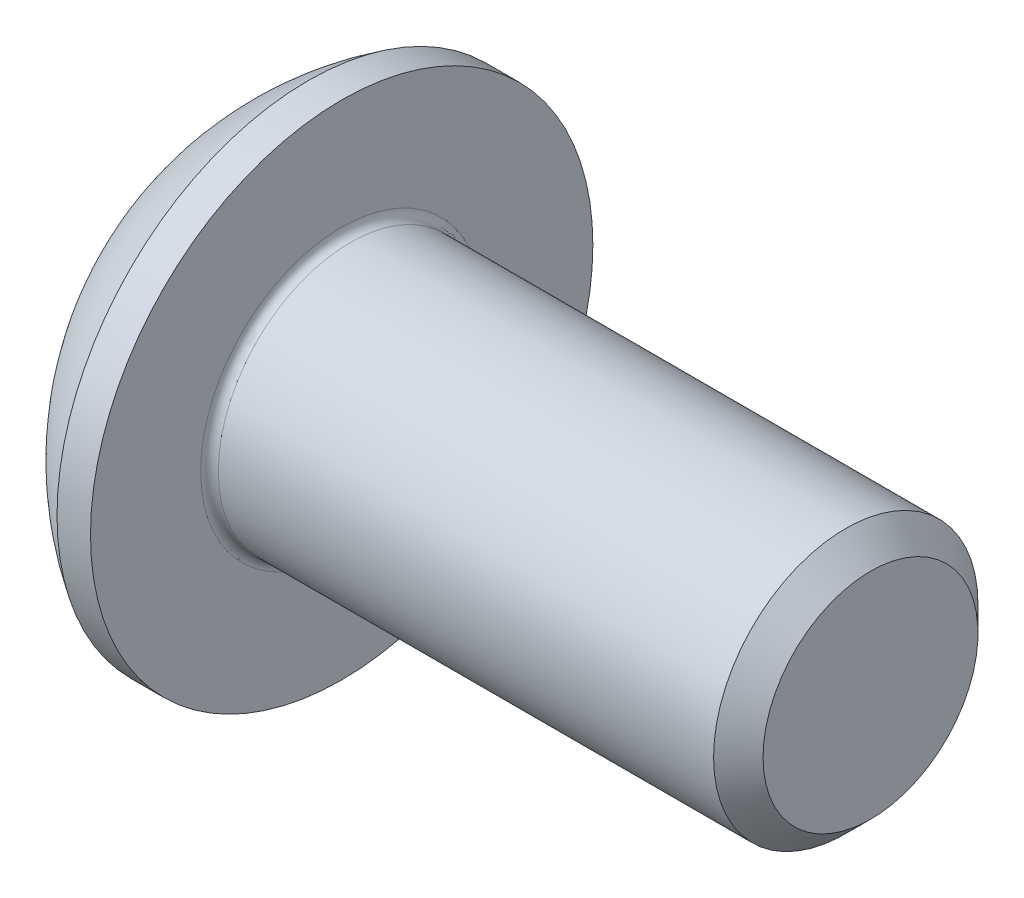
ISO-10303-21;
HEADER;
FILE_DESCRIPTION(('STEP AP214'),'2;1');
FILE_NAME('part.step','',(''),(''),'','','');
FILE_SCHEMA(('AUTOMOTIVE_DESIGN { 1 0 10303 214 1 1 1 1 }'));
ENDSEC;
DATA;
#1=APPLICATION_CONTEXT('core data for automotive mechanical design processes');
#2=APPLICATION_PROTOCOL_DEFINITION('international standard','automotive_design',2000,#1);
#3=PRODUCT_CONTEXT('',#1,'mechanical');
#4=PRODUCT('Part','Part','',(#3));
#5=PRODUCT_RELATED_PRODUCT_CATEGORY('part','',(#4));
#6=PRODUCT_DEFINITION_FORMATION('','',#4);
#7=PRODUCT_DEFINITION_CONTEXT('part definition',#1,'design');
#8=PRODUCT_DEFINITION('design','',#6,#7);
#9=PRODUCT_DEFINITION_SHAPE('','',#8);
#10=(LENGTH_UNIT() NAMED_UNIT(*) SI_UNIT(.MILLI.,.METRE.));
#11=(NAMED_UNIT(*) PLANE_ANGLE_UNIT() SI_UNIT($,.RADIAN.));
#12=(NAMED_UNIT(*) SI_UNIT($,.STERADIAN.) SOLID_ANGLE_UNIT());
#13=UNCERTAINTY_MEASURE_WITH_UNIT(LENGTH_MEASURE(1.E-05),#10,'distance_accuracy_value','');
#14=(GEOMETRIC_REPRESENTATION_CONTEXT(3) GLOBAL_UNCERTAINTY_ASSIGNED_CONTEXT((#13)) GLOBAL_UNIT_ASSIGNED_CONTEXT((#10,
#11,#12)) REPRESENTATION_CONTEXT('',''));
#15=CARTESIAN_POINT('',(0.,0.,0.));
#16=DIRECTION('',(0.,0.,1.));
#17=DIRECTION('',(1.,0.,0.));
#18=AXIS2_PLACEMENT_3D('',#15,#16,#17);
#19=CARTESIAN_POINT('',(0.,0.,0.));
#20=DIRECTION('',(-1.,0.,0.));
#21=DIRECTION('',(0.,0.,1.));
#22=AXIS2_PLACEMENT_3D('',#19,#20,#21);
#23=PLANE('',#22);
#24=CARTESIAN_POINT('',(0.,0.,0.));
#25=DIRECTION('',(-1.,0.,0.));
#26=DIRECTION('',(0.,0.,1.));
#27=AXIS2_PLACEMENT_3D('',#24,#25,#26);
#28=CIRCLE('',#27,1.425);
#29=CARTESIAN_POINT('',(0.,1.425,0.));
#30=VERTEX_POINT('',#29);
#31=EDGE_CURVE('E150',#30,#30,#28,.T.);
#32=ORIENTED_EDGE('',*,*,#31,.T.);
#33=EDGE_LOOP('',(#32));
#34=FACE_BOUND('',#33,.T.);
#35=DIRECTION('',(0.,-1.,0.));
#36=VECTOR('',#35,1.);
#37=CARTESIAN_POINT('',(0.,-0.577350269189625,0.999999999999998));
#38=LINE('',#37,#36);
#39=CARTESIAN_POINT('',(0.,0.577350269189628,1.));
#40=VERTEX_POINT('',#39);
#41=CARTESIAN_POINT('',(0.,-0.577350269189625,0.999999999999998));
#42=VERTEX_POINT('',#41);
#43=EDGE_CURVE('E45',#40,#42,#38,.T.);
#44=ORIENTED_EDGE('',*,*,#43,.T.);
#45=DIRECTION('',(0.,-0.499999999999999,-0.866025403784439));
#46=VECTOR('',#45,1.);
#47=CARTESIAN_POINT('',(0.,-1.15470053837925,0.));
#48=LINE('',#47,#46);
#49=CARTESIAN_POINT('',(0.,-1.15470053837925,0.));
#50=VERTEX_POINT('',#49);
#51=EDGE_CURVE('E270',#42,#50,#48,.T.);
#52=ORIENTED_EDGE('',*,*,#51,.T.);
#53=DIRECTION('',(0.,0.499999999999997,-0.86602540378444));
#54=VECTOR('',#53,1.);
#55=CARTESIAN_POINT('',(0.,-0.577350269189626,-1.));
#56=LINE('',#55,#54);
#57=CARTESIAN_POINT('',(0.,-0.577350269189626,-1.));
#58=VERTEX_POINT('',#57);
#59=EDGE_CURVE('E125',#50,#58,#56,.T.);
#60=ORIENTED_EDGE('',*,*,#59,.T.);
#61=DIRECTION('',(0.,1.,0.));
#62=VECTOR('',#61,1.);
#63=CARTESIAN_POINT('',(0.,0.577350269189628,-1.));
#64=LINE('',#63,#62);
#65=CARTESIAN_POINT('',(0.,0.577350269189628,-1.));
#66=VERTEX_POINT('',#65);
#67=EDGE_CURVE('E273',#58,#66,#64,.T.);
#68=ORIENTED_EDGE('',*,*,#67,.T.);
#69=DIRECTION('',(0.,0.499999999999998,0.866025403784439));
#70=VECTOR('',#69,1.);
#71=CARTESIAN_POINT('',(0.,1.15470053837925,0.));
#72=LINE('',#71,#70);
#73=CARTESIAN_POINT('',(0.,1.15470053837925,0.));
#74=VERTEX_POINT('',#73);
#75=EDGE_CURVE('E275',#66,#74,#72,.T.);
#76=ORIENTED_EDGE('',*,*,#75,.T.);
#77=DIRECTION('',(0.,-0.499999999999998,0.866025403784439));
#78=VECTOR('',#77,1.);
#79=CARTESIAN_POINT('',(0.,0.577350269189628,1.));
#80=LINE('',#79,#78);
#81=EDGE_CURVE('E277',#74,#40,#80,.T.);
#82=ORIENTED_EDGE('',*,*,#81,.T.);
#83=EDGE_LOOP('',(#44,#52,#60,#68,#76,#82));
#84=FACE_BOUND('',#83,.T.);
#85=ADVANCED_FACE('F30',(#34,#84),#23,.T.);
#86=CARTESIAN_POINT('',(3.03337598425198,0.,0.));
#87=DIRECTION('',(-1.,0.,0.));
#88=DIRECTION('',(0.,1.,0.));
#89=AXIS2_PLACEMENT_3D('',#86,#87,#88);
#90=SPHERICAL_SURFACE('',#89,3.35141684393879);
#91=CARTESIAN_POINT('',(1.27,0.,0.));
#92=DIRECTION('',(-1.,0.,0.));
#93=DIRECTION('',(0.,0.,1.));
#94=AXIS2_PLACEMENT_3D('',#91,#92,#93);
#95=CIRCLE('',#94,2.85);
#96=CARTESIAN_POINT('',(1.27,2.85,0.));
#97=VERTEX_POINT('',#96);
#98=EDGE_CURVE('E147',#97,#97,#95,.T.);
#99=CARTESIAN_POINT('',(1.27,2.85,0.));
#100=CARTESIAN_POINT('',(1.2528541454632,2.83939139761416,0.));
#101=CARTESIAN_POINT('',(1.23580404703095,2.82862803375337,0.));
#102=CARTESIAN_POINT('',(1.20190086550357,2.80679536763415,0.));
#103=CARTESIAN_POINT('',(1.18504778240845,2.79572606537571,0.));
#104=CARTESIAN_POINT('',(1.15154413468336,2.77328510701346,0.));
#105=CARTESIAN_POINT('',(1.13489357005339,2.76191345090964,0.));
#106=CARTESIAN_POINT('',(1.10180037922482,2.73887149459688,0.));
#107=CARTESIAN_POINT('',(1.08535775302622,2.72720119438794,0.));
#108=CARTESIAN_POINT('',(1.05268579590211,2.70356574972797,0.));
#109=CARTESIAN_POINT('',(1.03645646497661,2.69160060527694,0.));
#110=CARTESIAN_POINT('',(1.00421638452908,2.66737936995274,0.));
#111=CARTESIAN_POINT('',(0.988205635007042,2.65512327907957,0.));
#112=CARTESIAN_POINT('',(0.956407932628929,2.63032414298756,0.));
#113=CARTESIAN_POINT('',(0.940620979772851,2.61778109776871,0.));
#114=CARTESIAN_POINT('',(0.909276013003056,2.59241213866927,0.));
#115=CARTESIAN_POINT('',(0.89371799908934,2.57958622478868,0.));
#116=CARTESIAN_POINT('',(0.862835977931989,2.55365570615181,0.));
#117=CARTESIAN_POINT('',(0.847511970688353,2.54055110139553,0.));
#118=CARTESIAN_POINT('',(0.817102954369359,2.5140674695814,0.));
#119=CARTESIAN_POINT('',(0.802017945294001,2.50068844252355,0.));
#120=CARTESIAN_POINT('',(0.772091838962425,2.47366032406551,0.));
#121=CARTESIAN_POINT('',(0.757250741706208,2.46001123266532,0.));
#122=CARTESIAN_POINT('',(0.727817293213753,2.43244743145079,0.));
#123=CARTESIAN_POINT('',(0.713224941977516,2.41853272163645,0.));
#124=CARTESIAN_POINT('',(0.68429373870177,2.39044221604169,0.));
#125=CARTESIAN_POINT('',(0.669954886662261,2.37626642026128,0.));
#126=CARTESIAN_POINT('',(0.641535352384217,2.3476583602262,0.));
#127=CARTESIAN_POINT('',(0.627454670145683,2.33322609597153,0.));
#128=CARTESIAN_POINT('',(0.599556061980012,2.30410980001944,0.));
#129=CARTESIAN_POINT('',(0.585738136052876,2.289425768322,0.));
#130=CARTESIAN_POINT('',(0.55836954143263,2.25981072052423,0.));
#131=CARTESIAN_POINT('',(0.54481887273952,2.24487970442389,0.));
#132=CARTESIAN_POINT('',(0.517989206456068,2.21477555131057,0.));
#133=CARTESIAN_POINT('',(0.504710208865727,2.19960241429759,0.));
#134=CARTESIAN_POINT('',(0.478428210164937,2.16901896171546,0.));
#135=CARTESIAN_POINT('',(0.465425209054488,2.15360864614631,0.));
#136=CARTESIAN_POINT('',(0.439699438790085,2.12255585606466,0.));
#137=CARTESIAN_POINT('',(0.426976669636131,2.10691338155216,0.));
#138=CARTESIAN_POINT('',(0.401815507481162,2.07540136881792,0.));
#139=CARTESIAN_POINT('',(0.389377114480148,2.05953183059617,0.));
#140=CARTESIAN_POINT('',(0.364788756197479,2.02757085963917,0.));
#141=CARTESIAN_POINT('',(0.352638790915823,2.0114794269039,0.));
#142=CARTESIAN_POINT('',(0.328631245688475,1.97907990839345,0.));
#143=CARTESIAN_POINT('',(0.316773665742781,1.96277182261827,0.));
#144=CARTESIAN_POINT('',(0.293354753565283,1.92994431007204,0.));
#145=CARTESIAN_POINT('',(0.281793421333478,1.91342488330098,0.));
#146=CARTESIAN_POINT('',(0.258970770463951,1.88018006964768,0.));
#147=CARTESIAN_POINT('',(0.24770945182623,1.86345468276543,0.));
#148=CARTESIAN_POINT('',(0.225490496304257,1.82980339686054,0.));
#149=CARTESIAN_POINT('',(0.214532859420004,1.8128774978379,0.));
#150=CARTESIAN_POINT('',(0.192924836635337,1.77883070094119,0.));
#151=CARTESIAN_POINT('',(0.182274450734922,1.76170980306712,0.));
#152=CARTESIAN_POINT('',(0.161284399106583,1.72727858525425,0.));
#153=CARTESIAN_POINT('',(0.150944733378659,1.70996826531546,0.));
#154=CARTESIAN_POINT('',(0.13057948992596,1.6751638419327,0.));
#155=CARTESIAN_POINT('',(0.120553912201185,1.65766973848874,0.));
#156=CARTESIAN_POINT('',(0.100820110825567,1.62250344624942,0.));
#157=CARTESIAN_POINT('',(0.0911118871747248,1.60483125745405,0.));
#158=CARTESIAN_POINT('',(0.0720159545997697,1.56931455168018,0.));
#159=CARTESIAN_POINT('',(0.062628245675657,1.55147003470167,0.));
#160=CARTESIAN_POINT('',(0.0441764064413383,1.51561448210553,0.));
#161=CARTESIAN_POINT('',(0.0351122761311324,1.49760344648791,0.));
#162=CARTESIAN_POINT('',(0.017310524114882,1.46142073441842,0.));
#163=CARTESIAN_POINT('',(0.00857290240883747,1.44324905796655,0.));
#164=CARTESIAN_POINT('',(0.,1.425,0.));
#165=B_SPLINE_CURVE_WITH_KNOTS('',3,(#99,#100,#101,#102,#103,#104,#105,#106,#107,#108,#109,#110,
#111,#112,#113,#114,#115,#116,#117,#118,#119,#120,#121,#122,#123,#124,#125,#126,#127,#128,#129,
#130,#131,#132,#133,#134,#135,#136,#137,#138,#139,#140,#141,#142,#143,#144,#145,#146,#147,#148,
#149,#150,#151,#152,#153,#154,#155,#156,#157,#158,#159,#160,#161,#162,#163,#164),.UNSPECIFIED.,
.F.,.F.,(4,2,2,2,2,2,2,2,2,2,2,2,2,2,2,2,2,2,2,2,2,2,2,2,2,2,2,2,2,2,2,2,4),(0.,
0.0604864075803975,0.120972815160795,0.181459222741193,0.24194563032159,0.302432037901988,
0.362918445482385,0.423404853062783,0.483891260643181,0.544377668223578,0.604864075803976,
0.665350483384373,0.725836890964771,0.786323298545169,0.846809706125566,0.907296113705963,
0.967782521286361,1.02826892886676,1.08875533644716,1.14924174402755,1.20972815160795,
1.27021455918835,1.33070096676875,1.39118737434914,1.45167378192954,1.51216018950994,
1.57264659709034,1.63313300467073,1.69361941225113,1.75410581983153,1.81459222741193,
1.87507863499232,1.93556504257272),.UNSPECIFIED.);
#166=EDGE_CURVE('BSEAM171',#97,#30,#165,.T.);
#167=ORIENTED_EDGE('',*,*,#98,.T.);
#168=ORIENTED_EDGE('',*,*,#31,.F.);
#169=ORIENTED_EDGE('',*,*,#166,.T.);
#170=ORIENTED_EDGE('',*,*,#166,.F.);
#171=EDGE_LOOP('',(#167,#169,#168,#170));
#172=FACE_BOUND('',#171,.T.);
#173=ADVANCED_FACE('F171',(#172),#90,.T.);
#174=CARTESIAN_POINT('',(0.,0.,0.));
#175=DIRECTION('',(-1.,0.,0.));
#176=DIRECTION('',(0.,0.,1.));
#177=AXIS2_PLACEMENT_3D('',#174,#175,#176);
#178=CYLINDRICAL_SURFACE('',#177,2.85);
#179=ORIENTED_EDGE('',*,*,#98,.F.);
#180=EDGE_LOOP('',(#179));
#181=FACE_BOUND('',#180,.T.);
#182=CARTESIAN_POINT('',(1.65,0.,0.));
#183=DIRECTION('',(-1.,0.,0.));
#184=DIRECTION('',(0.,0.,1.));
#185=AXIS2_PLACEMENT_3D('',#182,#183,#184);
#186=CIRCLE('',#185,2.85);
#187=CARTESIAN_POINT('',(1.65,0.,2.85));
#188=VERTEX_POINT('',#187);
#189=EDGE_CURVE('E144',#188,#188,#186,.T.);
#190=ORIENTED_EDGE('',*,*,#189,.T.);
#191=EDGE_LOOP('',(#190));
#192=FACE_BOUND('',#191,.T.);
#193=ADVANCED_FACE('F176',(#181,#192),#178,.T.);
#194=CARTESIAN_POINT('',(1.65,1.49999999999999,0.));
#195=DIRECTION('',(-1.,0.,0.));
#196=DIRECTION('',(0.,0.,1.));
#197=AXIS2_PLACEMENT_3D('',#194,#195,#196);
#198=PLANE('',#197);
#199=CARTESIAN_POINT('',(1.65,0.,0.));
#200=DIRECTION('',(-1.,0.,0.));
#201=DIRECTION('',(0.,0.,1.));
#202=AXIS2_PLACEMENT_3D('',#199,#200,#201);
#203=CIRCLE('',#202,1.59999999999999);
#204=CARTESIAN_POINT('',(1.65,0.,1.59999999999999));
#205=VERTEX_POINT('',#204);
#206=EDGE_CURVE('E38',#205,#205,#203,.T.);
#207=ORIENTED_EDGE('',*,*,#206,.T.);
#208=EDGE_LOOP('',(#207));
#209=FACE_BOUND('',#208,.T.);
#210=ORIENTED_EDGE('',*,*,#189,.F.);
#211=EDGE_LOOP('',(#210));
#212=FACE_BOUND('',#211,.T.);
#213=ADVANCED_FACE('F155',(#209,#212),#198,.F.);
#214=CARTESIAN_POINT('',(0.,0.,0.));
#215=DIRECTION('',(-1.,0.,0.));
#216=DIRECTION('',(0.,0.,1.));
#217=AXIS2_PLACEMENT_3D('',#214,#215,#216);
#218=CYLINDRICAL_SURFACE('',#217,1.49999999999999);
#219=CARTESIAN_POINT('',(1.75,0.,0.));
#220=DIRECTION('',(-1.,0.,0.));
#221=DIRECTION('',(0.,0.,1.));
#222=AXIS2_PLACEMENT_3D('',#219,#220,#221);
#223=CIRCLE('',#222,1.49999999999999);
#224=CARTESIAN_POINT('',(1.75,0.,1.49999999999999));
#225=VERTEX_POINT('',#224);
#226=EDGE_CURVE('E11',#225,#225,#223,.F.);
#227=ORIENTED_EDGE('',*,*,#226,.T.);
#228=EDGE_LOOP('',(#227));
#229=FACE_BOUND('',#228,.T.);
#230=CARTESIAN_POINT('',(7.36950000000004,0.,0.));
#231=DIRECTION('',(-1.,0.,0.));
#232=DIRECTION('',(0.,0.,1.));
#233=AXIS2_PLACEMENT_3D('',#230,#231,#232);
#234=CIRCLE('',#233,1.49999999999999);
#235=CARTESIAN_POINT('',(7.36950000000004,0.,1.49999999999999));
#236=VERTEX_POINT('',#235);
#237=EDGE_CURVE('E141',#236,#236,#234,.T.);
#238=ORIENTED_EDGE('',*,*,#237,.T.);
#239=EDGE_LOOP('',(#238));
#240=FACE_BOUND('',#239,.T.);
#241=ADVANCED_FACE('F185',(#229,#240),#218,.T.);
#242=CARTESIAN_POINT('',(7.65,0.,0.));
#243=DIRECTION('',(-1.,0.,0.));
#244=DIRECTION('',(0.,0.,1.));
#245=AXIS2_PLACEMENT_3D('',#242,#243,#244);
#246=CONICAL_SURFACE('',#245,1.2195,0.785398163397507);
#247=ORIENTED_EDGE('',*,*,#237,.F.);
#248=EDGE_LOOP('',(#247));
#249=FACE_BOUND('',#248,.T.);
#250=CARTESIAN_POINT('',(7.65,0.,0.));
#251=DIRECTION('',(-1.,0.,0.));
#252=DIRECTION('',(0.,0.,1.));
#253=AXIS2_PLACEMENT_3D('',#250,#251,#252);
#254=CIRCLE('',#253,1.2195);
#255=CARTESIAN_POINT('',(7.65,0.,1.2195));
#256=VERTEX_POINT('',#255);
#257=EDGE_CURVE('E137',#256,#256,#254,.T.);
#258=ORIENTED_EDGE('',*,*,#257,.T.);
#259=EDGE_LOOP('',(#258));
#260=FACE_BOUND('',#259,.T.);
#261=ADVANCED_FACE('F166',(#249,#260),#246,.T.);
#262=CARTESIAN_POINT('',(7.65,0.,0.));
#263=DIRECTION('',(-1.,0.,0.));
#264=DIRECTION('',(0.,0.,1.));
#265=AXIS2_PLACEMENT_3D('',#262,#263,#264);
#266=PLANE('',#265);
#267=ORIENTED_EDGE('',*,*,#257,.F.);
#268=EDGE_LOOP('',(#267));
#269=FACE_BOUND('',#268,.T.);
#270=ADVANCED_FACE('F159',(#269),#266,.F.);
#271=CARTESIAN_POINT('',(1.75,0.,0.));
#272=DIRECTION('',(-1.,0.,0.));
#273=DIRECTION('',(0.,0.,1.));
#274=AXIS2_PLACEMENT_3D('',#271,#272,#273);
#275=TOROIDAL_SURFACE('',#274,1.59999999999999,0.1);
#276=ORIENTED_EDGE('',*,*,#226,.F.);
#277=EDGE_LOOP('',(#276));
#278=FACE_BOUND('',#277,.T.);
#279=ORIENTED_EDGE('',*,*,#206,.F.);
#280=EDGE_LOOP('',(#279));
#281=FACE_BOUND('',#280,.T.);
#282=ADVANCED_FACE('F32',(#278,#281),#275,.F.);
#283=CARTESIAN_POINT('',(1.04,-1.15470053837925,0.));
#284=DIRECTION('',(0.,0.866025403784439,-0.499999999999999));
#285=DIRECTION('',(0.,0.499999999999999,0.866025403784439));
#286=AXIS2_PLACEMENT_3D('',#283,#284,#285);
#287=PLANE('',#286);
#288=DIRECTION('',(0.,-0.499999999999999,-0.866025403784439));
#289=VECTOR('',#288,1.);
#290=CARTESIAN_POINT('',(1.04,-1.15470053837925,0.));
#291=LINE('',#290,#289);
#292=CARTESIAN_POINT('',(1.04,-0.577350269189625,0.999999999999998));
#293=VERTEX_POINT('',#292);
#294=CARTESIAN_POINT('',(1.04,-0.866025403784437,0.499999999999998));
#295=VERTEX_POINT('',#294);
#296=EDGE_CURVE('E111',#293,#295,#291,.T.);
#297=ORIENTED_EDGE('',*,*,#296,.T.);
#298=CARTESIAN_POINT('',(1.04,-1.15470053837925,0.));
#299=VERTEX_POINT('',#298);
#300=EDGE_CURVE('E106',#295,#299,#291,.T.);
#301=ORIENTED_EDGE('',*,*,#300,.T.);
#302=DIRECTION('',(-1.,0.,0.));
#303=VECTOR('',#302,1.);
#304=CARTESIAN_POINT('',(1.04,-1.15470053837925,0.));
#305=LINE('',#304,#303);
#306=EDGE_CURVE('E108',#299,#50,#305,.T.);
#307=ORIENTED_EDGE('',*,*,#306,.T.);
#308=ORIENTED_EDGE('',*,*,#51,.F.);
#309=DIRECTION('',(-1.,0.,0.));
#310=VECTOR('',#309,1.);
#311=CARTESIAN_POINT('',(1.04,-0.577350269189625,0.999999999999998));
#312=LINE('',#311,#310);
#313=EDGE_CURVE('E266',#293,#42,#312,.T.);
#314=ORIENTED_EDGE('',*,*,#313,.F.);
#315=EDGE_LOOP('',(#297,#301,#307,#308,#314));
#316=FACE_BOUND('',#315,.T.);
#317=ADVANCED_FACE('F107',(#316),#287,.T.);
#318=CARTESIAN_POINT('',(1.04,-0.577350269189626,-1.));
#319=DIRECTION('',(0.,0.86602540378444,0.499999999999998));
#320=DIRECTION('',(0.,-0.499999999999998,0.86602540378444));
#321=AXIS2_PLACEMENT_3D('',#318,#319,#320);
#322=PLANE('',#321);
#323=DIRECTION('',(0.,0.499999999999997,-0.86602540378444));
#324=VECTOR('',#323,1.);
#325=CARTESIAN_POINT('',(1.04,-0.577350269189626,-1.));
#326=LINE('',#325,#324);
#327=CARTESIAN_POINT('',(1.04,-0.86602540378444,-0.499999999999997));
#328=VERTEX_POINT('',#327);
#329=EDGE_CURVE('E53',#299,#328,#326,.T.);
#330=ORIENTED_EDGE('',*,*,#329,.T.);
#331=CARTESIAN_POINT('',(1.04,-0.577350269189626,-1.));
#332=VERTEX_POINT('',#331);
#333=EDGE_CURVE('E120',#328,#332,#326,.T.);
#334=ORIENTED_EDGE('',*,*,#333,.T.);
#335=DIRECTION('',(-1.,0.,0.));
#336=VECTOR('',#335,1.);
#337=CARTESIAN_POINT('',(1.04,-0.577350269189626,-1.));
#338=LINE('',#337,#336);
#339=EDGE_CURVE('E127',#332,#58,#338,.T.);
#340=ORIENTED_EDGE('',*,*,#339,.T.);
#341=ORIENTED_EDGE('',*,*,#59,.F.);
#342=ORIENTED_EDGE('',*,*,#306,.F.);
#343=EDGE_LOOP('',(#330,#334,#340,#341,#342));
#344=FACE_BOUND('',#343,.T.);
#345=ADVANCED_FACE('F123',(#344),#322,.T.);
#346=CARTESIAN_POINT('',(1.04,0.577350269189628,-1.));
#347=DIRECTION('',(0.,0.,1.));
#348=DIRECTION('',(0.,-1.,0.));
#349=AXIS2_PLACEMENT_3D('',#346,#347,#348);
#350=PLANE('',#349);
#351=DIRECTION('',(0.,1.,0.));
#352=VECTOR('',#351,1.);
#353=CARTESIAN_POINT('',(1.04,0.577350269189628,-1.));
#354=LINE('',#353,#352);
#355=CARTESIAN_POINT('',(1.04,0.,-1.));
#356=VERTEX_POINT('',#355);
#357=EDGE_CURVE('E247',#332,#356,#354,.T.);
#358=ORIENTED_EDGE('',*,*,#357,.T.);
#359=CARTESIAN_POINT('',(1.04,0.577350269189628,-1.));
#360=VERTEX_POINT('',#359);
#361=EDGE_CURVE('E119',#356,#360,#354,.T.);
#362=ORIENTED_EDGE('',*,*,#361,.T.);
#363=DIRECTION('',(-1.,0.,0.));
#364=VECTOR('',#363,1.);
#365=CARTESIAN_POINT('',(1.04,0.577350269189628,-1.));
#366=LINE('',#365,#364);
#367=EDGE_CURVE('E132',#360,#66,#366,.T.);
#368=ORIENTED_EDGE('',*,*,#367,.T.);
#369=ORIENTED_EDGE('',*,*,#67,.F.);
#370=ORIENTED_EDGE('',*,*,#339,.F.);
#371=EDGE_LOOP('',(#358,#362,#368,#369,#370));
#372=FACE_BOUND('',#371,.T.);
#373=ADVANCED_FACE('F199',(#372),#350,.T.);
#374=CARTESIAN_POINT('',(1.04,1.15470053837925,0.));
#375=DIRECTION('',(0.,-0.86602540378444,0.499999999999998));
#376=DIRECTION('',(0.,-0.499999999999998,-0.86602540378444));
#377=AXIS2_PLACEMENT_3D('',#374,#375,#376);
#378=PLANE('',#377);
#379=DIRECTION('',(0.,0.499999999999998,0.866025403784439));
#380=VECTOR('',#379,1.);
#381=CARTESIAN_POINT('',(1.04,1.15470053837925,0.));
#382=LINE('',#381,#380);
#383=CARTESIAN_POINT('',(1.04,0.86602540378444,-0.499999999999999));
#384=VERTEX_POINT('',#383);
#385=EDGE_CURVE('E236',#360,#384,#382,.T.);
#386=ORIENTED_EDGE('',*,*,#385,.T.);
#387=CARTESIAN_POINT('',(1.04,1.15470053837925,0.));
#388=VERTEX_POINT('',#387);
#389=EDGE_CURVE('E241',#384,#388,#382,.T.);
#390=ORIENTED_EDGE('',*,*,#389,.T.);
#391=DIRECTION('',(-1.,0.,0.));
#392=VECTOR('',#391,1.);
#393=CARTESIAN_POINT('',(1.04,1.15470053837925,0.));
#394=LINE('',#393,#392);
#395=EDGE_CURVE('E281',#388,#74,#394,.T.);
#396=ORIENTED_EDGE('',*,*,#395,.T.);
#397=ORIENTED_EDGE('',*,*,#75,.F.);
#398=ORIENTED_EDGE('',*,*,#367,.F.);
#399=EDGE_LOOP('',(#386,#390,#396,#397,#398));
#400=FACE_BOUND('',#399,.T.);
#401=ADVANCED_FACE('F202',(#400),#378,.T.);
#402=CARTESIAN_POINT('',(1.04,0.577350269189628,1.));
#403=DIRECTION('',(0.,-0.86602540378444,-0.499999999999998));
#404=DIRECTION('',(0.,0.499999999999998,-0.86602540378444));
#405=AXIS2_PLACEMENT_3D('',#402,#403,#404);
#406=PLANE('',#405);
#407=DIRECTION('',(0.,-0.499999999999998,0.866025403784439));
#408=VECTOR('',#407,1.);
#409=CARTESIAN_POINT('',(1.04,0.577350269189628,1.));
#410=LINE('',#409,#408);
#411=CARTESIAN_POINT('',(1.04,0.86602540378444,0.499999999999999));
#412=VERTEX_POINT('',#411);
#413=EDGE_CURVE('E244',#388,#412,#410,.T.);
#414=ORIENTED_EDGE('',*,*,#413,.T.);
#415=CARTESIAN_POINT('',(1.04,0.577350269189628,1.));
#416=VERTEX_POINT('',#415);
#417=EDGE_CURVE('E252',#412,#416,#410,.T.);
#418=ORIENTED_EDGE('',*,*,#417,.T.);
#419=DIRECTION('',(-1.,0.,0.));
#420=VECTOR('',#419,1.);
#421=CARTESIAN_POINT('',(1.04,0.577350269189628,1.));
#422=LINE('',#421,#420);
#423=EDGE_CURVE('E265',#416,#40,#422,.T.);
#424=ORIENTED_EDGE('',*,*,#423,.T.);
#425=ORIENTED_EDGE('',*,*,#81,.F.);
#426=ORIENTED_EDGE('',*,*,#395,.F.);
#427=EDGE_LOOP('',(#414,#418,#424,#425,#426));
#428=FACE_BOUND('',#427,.T.);
#429=ADVANCED_FACE('F206',(#428),#406,.T.);
#430=CARTESIAN_POINT('',(1.04,-0.577350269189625,0.999999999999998));
#431=DIRECTION('',(0.,0.,-1.));
#432=DIRECTION('',(0.,1.,0.));
#433=AXIS2_PLACEMENT_3D('',#430,#431,#432);
#434=PLANE('',#433);
#435=DIRECTION('',(0.,-1.,0.));
#436=VECTOR('',#435,1.);
#437=CARTESIAN_POINT('',(1.04,-0.577350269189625,0.999999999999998));
#438=LINE('',#437,#436);
#439=CARTESIAN_POINT('',(1.04,0.,1.));
#440=VERTEX_POINT('',#439);
#441=EDGE_CURVE('E258',#416,#440,#438,.T.);
#442=ORIENTED_EDGE('',*,*,#441,.T.);
#443=EDGE_CURVE('E260',#440,#293,#438,.T.);
#444=ORIENTED_EDGE('',*,*,#443,.T.);
#445=ORIENTED_EDGE('',*,*,#313,.T.);
#446=ORIENTED_EDGE('',*,*,#43,.F.);
#447=ORIENTED_EDGE('',*,*,#423,.F.);
#448=EDGE_LOOP('',(#442,#444,#445,#446,#447));
#449=FACE_BOUND('',#448,.T.);
#450=ADVANCED_FACE('F210',(#449),#434,.T.);
#451=CARTESIAN_POINT('',(1.04,-1.73205080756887,-0.999999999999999));
#452=DIRECTION('',(1.,0.,0.));
#453=DIRECTION('',(0.,0.,-1.));
#454=AXIS2_PLACEMENT_3D('',#451,#452,#453);
#455=PLANE('',#454);
#456=CARTESIAN_POINT('',(1.04,0.,0.));
#457=DIRECTION('',(-1.,0.,0.));
#458=DIRECTION('',(0.,0.,1.));
#459=AXIS2_PLACEMENT_3D('',#456,#457,#458);
#460=CIRCLE('',#459,1.);
#461=EDGE_CURVE('E233',#384,#356,#460,.T.);
#462=ORIENTED_EDGE('',*,*,#461,.F.);
#463=ORIENTED_EDGE('',*,*,#385,.F.);
#464=ORIENTED_EDGE('',*,*,#361,.F.);
#465=EDGE_LOOP('',(#462,#463,#464));
#466=FACE_BOUND('',#465,.T.);
#467=ADVANCED_FACE('F214',(#466),#455,.F.);
#468=EDGE_CURVE('E138',#412,#384,#460,.T.);
#469=ORIENTED_EDGE('',*,*,#468,.F.);
#470=ORIENTED_EDGE('',*,*,#413,.F.);
#471=ORIENTED_EDGE('',*,*,#389,.F.);
#472=EDGE_LOOP('',(#469,#470,#471));
#473=FACE_BOUND('',#472,.T.);
#474=ADVANCED_FACE('F223',(#473),#455,.F.);
#475=EDGE_CURVE('E131',#440,#412,#460,.T.);
#476=ORIENTED_EDGE('',*,*,#475,.F.);
#477=ORIENTED_EDGE('',*,*,#441,.F.);
#478=ORIENTED_EDGE('',*,*,#417,.F.);
#479=EDGE_LOOP('',(#476,#477,#478));
#480=FACE_BOUND('',#479,.T.);
#481=ADVANCED_FACE('F228',(#480),#455,.F.);
#482=EDGE_CURVE('E126',#295,#440,#460,.T.);
#483=ORIENTED_EDGE('',*,*,#482,.F.);
#484=ORIENTED_EDGE('',*,*,#296,.F.);
#485=ORIENTED_EDGE('',*,*,#443,.F.);
#486=EDGE_LOOP('',(#483,#484,#485));
#487=FACE_BOUND('',#486,.T.);
#488=ADVANCED_FACE('F221',(#487),#455,.F.);
#489=EDGE_CURVE('E117',#328,#295,#460,.T.);
#490=ORIENTED_EDGE('',*,*,#489,.F.);
#491=ORIENTED_EDGE('',*,*,#329,.F.);
#492=ORIENTED_EDGE('',*,*,#300,.F.);
#493=EDGE_LOOP('',(#490,#491,#492));
#494=FACE_BOUND('',#493,.T.);
#495=ADVANCED_FACE('F116',(#494),#455,.F.);
#496=EDGE_CURVE('E239',#356,#328,#460,.T.);
#497=ORIENTED_EDGE('',*,*,#496,.F.);
#498=ORIENTED_EDGE('',*,*,#357,.F.);
#499=ORIENTED_EDGE('',*,*,#333,.F.);
#500=EDGE_LOOP('',(#497,#498,#499));
#501=FACE_BOUND('',#500,.T.);
#502=ADVANCED_FACE('F194',(#501),#455,.F.);
#503=CARTESIAN_POINT('',(1.61735026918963,0.,0.));
#504=DIRECTION('',(-1.,0.,0.));
#505=DIRECTION('',(0.,0.,1.));
#506=AXIS2_PLACEMENT_3D('',#503,#504,#505);
#507=CONICAL_SURFACE('',#506,0.,1.04719755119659);
#508=ORIENTED_EDGE('',*,*,#475,.T.);
#509=ORIENTED_EDGE('',*,*,#468,.T.);
#510=ORIENTED_EDGE('',*,*,#461,.T.);
#511=ORIENTED_EDGE('',*,*,#496,.T.);
#512=ORIENTED_EDGE('',*,*,#489,.T.);
#513=ORIENTED_EDGE('',*,*,#482,.T.);
#514=EDGE_LOOP('',(#508,#509,#510,#511,#512,#513));
#515=FACE_BOUND('',#514,.T.);
#516=CARTESIAN_POINT('',(1.61735026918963,0.,0.));
#517=VERTEX_POINT('',#516);
#518=VERTEX_LOOP('',#517);
#519=FACE_BOUND('',#518,.T.);
#520=ADVANCED_FACE('F192',(#515,#519),#507,.F.);
#521=CLOSED_SHELL('',(#85,#173,#193,#213,#241,#261,#270,#282,#317,#345,#373,#401,#429,#450,#467,
#474,#481,#488,#495,#502,#520));
#522=MANIFOLD_SOLID_BREP('B2',#521);
#523=ADVANCED_BREP_SHAPE_REPRESENTATION('',(#18,#522),#14);
#524=SHAPE_DEFINITION_REPRESENTATION(#9,#523);
ENDSEC;
END-ISO-10303-21;
